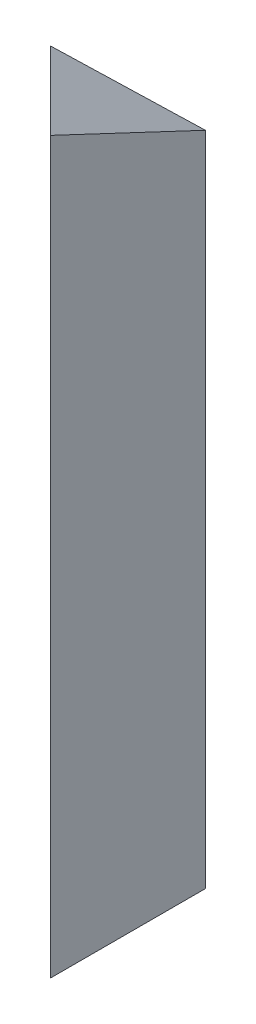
ISO-10303-21;
HEADER;
FILE_DESCRIPTION(('STEP AP214'),'2;1');
FILE_NAME('part.step','',(''),(''),'','','');
FILE_SCHEMA(('AUTOMOTIVE_DESIGN { 1 0 10303 214 1 1 1 1 }'));
ENDSEC;
DATA;
#1=APPLICATION_CONTEXT('core data for automotive mechanical design processes');
#2=APPLICATION_PROTOCOL_DEFINITION('international standard','automotive_design',2000,#1);
#3=PRODUCT_CONTEXT('',#1,'mechanical');
#4=PRODUCT('Part','Part','',(#3));
#5=PRODUCT_RELATED_PRODUCT_CATEGORY('part','',(#4));
#6=PRODUCT_DEFINITION_FORMATION('','',#4);
#7=PRODUCT_DEFINITION_CONTEXT('part definition',#1,'design');
#8=PRODUCT_DEFINITION('design','',#6,#7);
#9=PRODUCT_DEFINITION_SHAPE('','',#8);
#10=(LENGTH_UNIT() NAMED_UNIT(*) SI_UNIT(.MILLI.,.METRE.));
#11=(NAMED_UNIT(*) PLANE_ANGLE_UNIT() SI_UNIT($,.RADIAN.));
#12=(NAMED_UNIT(*) SI_UNIT($,.STERADIAN.) SOLID_ANGLE_UNIT());
#13=UNCERTAINTY_MEASURE_WITH_UNIT(LENGTH_MEASURE(1.E-05),#10,'distance_accuracy_value','');
#14=(GEOMETRIC_REPRESENTATION_CONTEXT(3) GLOBAL_UNCERTAINTY_ASSIGNED_CONTEXT((#13)) GLOBAL_UNIT_ASSIGNED_CONTEXT((#10,
#11,#12)) REPRESENTATION_CONTEXT('',''));
#15=CARTESIAN_POINT('',(0.,0.,0.));
#16=DIRECTION('',(0.,0.,1.));
#17=DIRECTION('',(1.,0.,0.));
#18=AXIS2_PLACEMENT_3D('',#15,#16,#17);
#19=CARTESIAN_POINT('',(-356.173432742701,6.83625031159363,81.1823241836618));
#20=DIRECTION('',(0.707106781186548,0.,-0.707106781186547));
#21=DIRECTION('',(-0.707106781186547,0.,-0.707106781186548));
#22=AXIS2_PLACEMENT_3D('',#19,#20,#21);
#23=PLANE('',#22);
#24=DIRECTION('',(-0.707106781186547,0.,-0.707106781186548));
#25=VECTOR('',#24,1.);
#26=CARTESIAN_POINT('',(-356.173432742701,26.8362503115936,81.1823241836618));
#27=LINE('',#26,#25);
#28=CARTESIAN_POINT('',(-354.052115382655,26.8362503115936,83.3036415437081));
#29=VERTEX_POINT('',#28);
#30=CARTESIAN_POINT('',(-356.173432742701,26.8362503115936,81.1823241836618));
#31=VERTEX_POINT('',#30);
#32=EDGE_CURVE('E33',#29,#31,#27,.T.);
#33=ORIENTED_EDGE('',*,*,#32,.T.);
#34=DIRECTION('',(0.,-1.,0.));
#35=VECTOR('',#34,1.);
#36=CARTESIAN_POINT('',(-356.173432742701,6.83625031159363,81.1823241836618));
#37=LINE('',#36,#35);
#38=CARTESIAN_POINT('',(-356.173432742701,6.83625031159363,81.1823241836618));
#39=VERTEX_POINT('',#38);
#40=EDGE_CURVE('E65',#31,#39,#37,.T.);
#41=ORIENTED_EDGE('',*,*,#40,.T.);
#42=DIRECTION('',(-0.707106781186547,0.,-0.707106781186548));
#43=VECTOR('',#42,1.);
#44=CARTESIAN_POINT('',(-356.173432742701,6.83625031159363,81.1823241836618));
#45=LINE('',#44,#43);
#46=CARTESIAN_POINT('',(-354.052112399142,6.83625031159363,83.3036445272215));
#47=VERTEX_POINT('',#46);
#48=EDGE_CURVE('E58',#47,#39,#45,.T.);
#49=ORIENTED_EDGE('',*,*,#48,.F.);
#50=DIRECTION('',(0.,1.,0.));
#51=VECTOR('',#50,1.);
#52=CARTESIAN_POINT('',(-354.052112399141,-66.1341851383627,83.3036445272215));
#53=LINE('',#52,#51);
#54=EDGE_CURVE('E48',#47,#29,#53,.T.);
#55=ORIENTED_EDGE('',*,*,#54,.T.);
#56=EDGE_LOOP('',(#33,#41,#49,#55));
#57=FACE_BOUND('',#56,.T.);
#58=ADVANCED_FACE('F30',(#57),#23,.F.);
#59=CARTESIAN_POINT('',(-356.173432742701,26.8362503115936,81.1823241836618));
#60=DIRECTION('',(0.392232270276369,0.832050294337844,-0.392232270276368));
#61=DIRECTION('',(-0.904534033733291,0.426401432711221,0.));
#62=AXIS2_PLACEMENT_3D('',#59,#60,#61);
#63=PLANE('',#62);
#64=ORIENTED_EDGE('',*,*,#32,.F.);
#65=DIRECTION('',(-6.36087544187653E-07,0.426401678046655,0.904533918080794));
#66=VECTOR('',#65,1.);
#67=CARTESIAN_POINT('',(-354.052112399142,24.8362503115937,79.0610038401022));
#68=LINE('',#67,#66);
#69=CARTESIAN_POINT('',(-354.052112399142,24.8362503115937,79.0610038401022));
#70=VERTEX_POINT('',#69);
#71=EDGE_CURVE('E79',#70,#29,#68,.T.);
#72=ORIENTED_EDGE('',*,*,#71,.F.);
#73=DIRECTION('',(-0.588348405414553,0.554700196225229,0.588348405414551));
#74=VECTOR('',#73,1.);
#75=CARTESIAN_POINT('',(-356.173432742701,26.8362503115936,81.1823241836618));
#76=LINE('',#75,#74);
#77=EDGE_CURVE('E70',#70,#31,#76,.T.);
#78=ORIENTED_EDGE('',*,*,#77,.T.);
#79=EDGE_LOOP('',(#64,#72,#78));
#80=FACE_BOUND('',#79,.T.);
#81=ADVANCED_FACE('F78',(#80),#63,.T.);
#82=CARTESIAN_POINT('',(-356.173432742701,26.8362503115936,81.1823241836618));
#83=DIRECTION('',(0.707106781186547,0.,0.707106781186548));
#84=DIRECTION('',(0.707106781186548,0.,-0.707106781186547));
#85=AXIS2_PLACEMENT_3D('',#82,#83,#84);
#86=PLANE('',#85);
#87=DIRECTION('',(0.707106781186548,0.,-0.707106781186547));
#88=VECTOR('',#87,1.);
#89=CARTESIAN_POINT('',(-334.960229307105,6.83625031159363,59.9691207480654));
#90=LINE('',#89,#88);
#91=CARTESIAN_POINT('',(-354.052112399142,6.83625031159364,79.0610038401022));
#92=VERTEX_POINT('',#91);
#93=EDGE_CURVE('E72',#39,#92,#90,.T.);
#94=ORIENTED_EDGE('',*,*,#93,.F.);
#95=ORIENTED_EDGE('',*,*,#40,.F.);
#96=ORIENTED_EDGE('',*,*,#77,.F.);
#97=DIRECTION('',(0.,-1.,0.));
#98=VECTOR('',#97,1.);
#99=CARTESIAN_POINT('',(-354.052112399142,26.8362503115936,79.0610038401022));
#100=LINE('',#99,#98);
#101=EDGE_CURVE('E39',#70,#92,#100,.T.);
#102=ORIENTED_EDGE('',*,*,#101,.T.);
#103=EDGE_LOOP('',(#94,#95,#96,#102));
#104=FACE_BOUND('',#103,.T.);
#105=ADVANCED_FACE('F67',(#104),#86,.F.);
#106=CARTESIAN_POINT('',(-356.173432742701,6.83625031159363,81.1823241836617));
#107=DIRECTION('',(0.,-1.,0.));
#108=DIRECTION('',(1.,0.,0.));
#109=AXIS2_PLACEMENT_3D('',#106,#107,#108);
#110=PLANE('',#109);
#111=ORIENTED_EDGE('',*,*,#48,.T.);
#112=ORIENTED_EDGE('',*,*,#93,.T.);
#113=DIRECTION('',(0.,0.,1.));
#114=VECTOR('',#113,1.);
#115=CARTESIAN_POINT('',(-354.052112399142,6.83625031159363,79.0610038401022));
#116=LINE('',#115,#114);
#117=EDGE_CURVE('E11',#92,#47,#116,.T.);
#118=ORIENTED_EDGE('',*,*,#117,.T.);
#119=EDGE_LOOP('',(#111,#112,#118));
#120=FACE_BOUND('',#119,.T.);
#121=ADVANCED_FACE('F86',(#120),#110,.T.);
#122=CARTESIAN_POINT('',(-354.052112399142,6.83625031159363,81.1823241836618));
#123=DIRECTION('',(-0.999999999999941,-7.85135347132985E-08,-3.33104716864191E-07));
#124=DIRECTION('',(-3.33104716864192E-07,0.,0.999999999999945));
#125=AXIS2_PLACEMENT_3D('',#122,#123,#124);
#126=PLANE('',#125);
#127=ORIENTED_EDGE('',*,*,#54,.F.);
#128=ORIENTED_EDGE('',*,*,#117,.F.);
#129=ORIENTED_EDGE('',*,*,#101,.F.);
#130=ORIENTED_EDGE('',*,*,#71,.T.);
#131=EDGE_LOOP('',(#127,#128,#129,#130));
#132=FACE_BOUND('',#131,.T.);
#133=ADVANCED_FACE('F85',(#132),#126,.F.);
#134=CLOSED_SHELL('',(#58,#81,#105,#121,#133));
#135=MANIFOLD_SOLID_BREP('B2',#134);
#136=ADVANCED_BREP_SHAPE_REPRESENTATION('',(#18,#135),#14);
#137=SHAPE_DEFINITION_REPRESENTATION(#9,#136);
ENDSEC;
END-ISO-10303-21;
